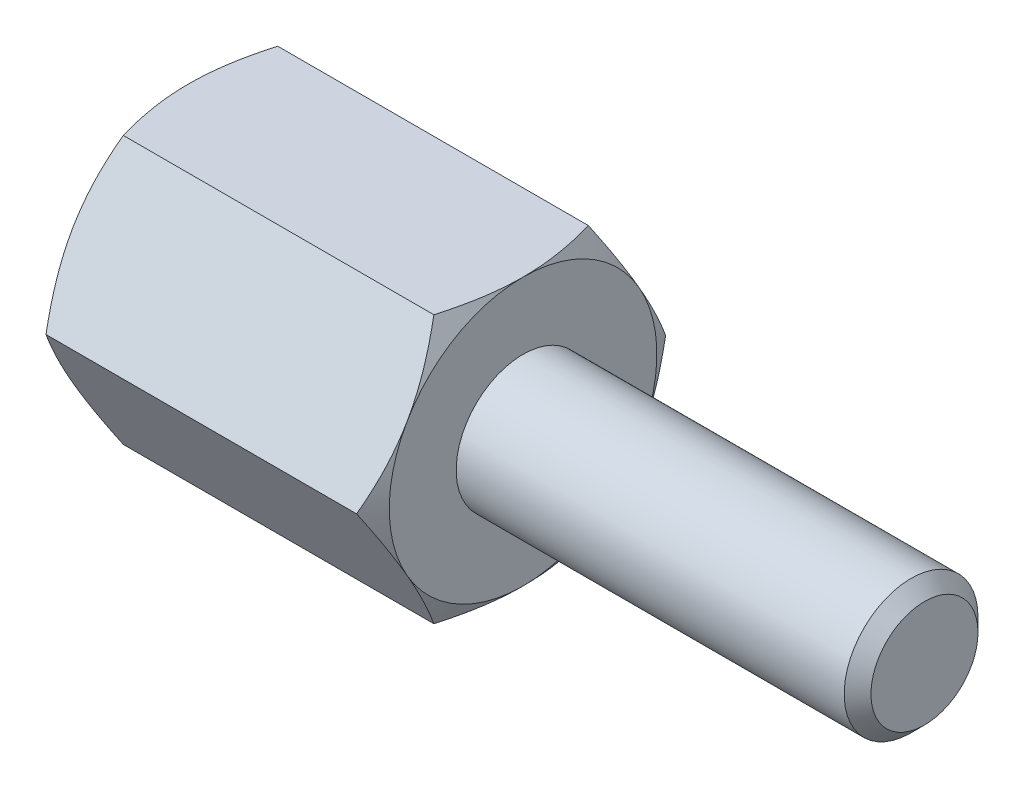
from build123d import *

# Parameters (mm, degrees)
EXTRUDE2_DEPTH = 2.5
SKETCH3_R      = 0.8
EXTRUDE3_DEPTH = 2.5
SKETCH5_R      = 1
EXTRUDE4_DEPTH = 6
CHAMFER1_SIZE  = 0.2


with BuildPart() as part:
    # Sketch1 → Extrude2 (new, symmetric)
    with BuildSketch(Plane(origin=(0, 0, 0), x_dir=(0, 0, -1), z_dir=(1, 0, 0))):
        Polygon((1.154700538, 2), (-1.154700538, 2), (-2.309401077, 0), (-1.154700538, -2), (1.154700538, -2), (2.309401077, 0), align=None)
    extrude(amount=EXTRUDE2_DEPTH, both=True)

    # Sketch2 → Cut-Revolve1 (revolve, cut)
    with BuildSketch(Plane.XY):
        with BuildLine():
            Line((-2.5, 2), (-1, 4.598076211))
            ThreePointArc((-1, 4.598076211), (-1.48810136, 5.776457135), (-2.5, 5))
            Line((-2.5, 5), (-2.5, 2))
        make_face()
    cut_revolve1 = revolve(axis=Axis((0, 0, 0), (1, 0, 0)), mode=Mode.SUBTRACT)

    # Mirror1: Cut-Revolve1 across plane
    add(cut_revolve1.mirror(Plane(origin=(0, 0, 0), x_dir=(0, 0, 1), z_dir=(1, 0, 0))), mode=Mode.SUBTRACT)

    # Sketch3 → Extrude3 (cut)
    with BuildSketch(Plane.ZY.offset(2.5)):
        Circle(SKETCH3_R)
    extrude(amount=-EXTRUDE3_DEPTH, mode=Mode.SUBTRACT)

    # Sketch4 → Cut-Revolve2 (revolve, cut)
    with BuildSketch(Plane.XY, mode=Mode.PRIVATE) as cut_revolve2_sk:
        Polygon((0, 0), (0, 0.8), (0.461880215, 0), align=None)
    revolve(cut_revolve2_sk.sketch.rotate(Axis((0.461880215, 0, 0), (-1, 0, 0)), 180), axis=Axis((0.461880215, 0, 0), (-1, 0, 0)), mode=Mode.SUBTRACT)

    # Sketch5 → Extrude4 (add)
    with BuildSketch(Plane(origin=(2.5, 0, 0), x_dir=(0, 0, -1), z_dir=(1, 0, 0))):
        Circle(SKETCH5_R)
    extrude(amount=EXTRUDE4_DEPTH)

    # Chamfer1
    chamfer1_edges = [part.edges().sort_by_distance(p)[0] for p in [
        (8.5, 0, 1),
    ]]
    chamfer(chamfer1_edges, length=CHAMFER1_SIZE)


solid = part.part
